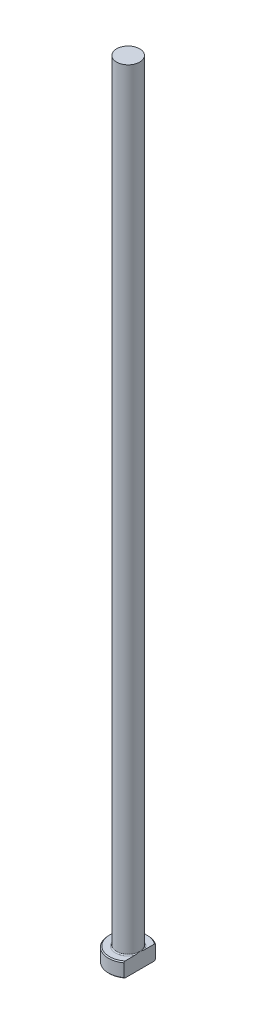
from build123d import *
from build123d.topology import SkipClean

# Parameters (mm, degrees)
CHAMFER1_SIZE = 0.2
FILLET1_R     = 0.2
KEY_DEPTH     = 161.09996877


with BuildPart() as part:
    # Sketch1 → Revolve1 (revolve)
    with BuildSketch(Plane.XY, mode=Mode.PRIVATE) as revolve1_sk:
        Polygon((0, 0), (-4, 0), (-4, 3), (-2.35, 3), (-2.35, 160), (0, 160), align=None)
    revolve(revolve1_sk.sketch.rotate(Axis((0, 259.958771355, 0), (0, -1, 0)), 270), axis=Axis((0, 259.958771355, 0), (0, -1, 0)))

    # Chamfer1
    chamfer1_edges = [part.edges().sort_by_distance(p)[0] for p in [
        (0, 3, -4),
        (0, 0, -4),
    ]]
    chamfer(chamfer1_edges, length=CHAMFER1_SIZE)

    # Fillet1
    fillet1_edges = [part.edges().sort_by_distance(p)[0] for p in [
        (0, 3, -2.35),
    ]]
    fillet(fillet1_edges, radius=FILLET1_R)

    # Sketch2 → KEY (cut, through all)
    with SkipClean():  # the faces are left unmerged after this step: merging them gives an invalid solid
        with BuildSketch(Plane(origin=(0, 0, 0), x_dir=(1, 0, 0), z_dir=(0, 1, 0))):
            with BuildLine():
                Line((2.35, 3.236896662), (2.35, -3.236896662))
                ThreePointArc((2.35, -3.236896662), (4, 0), (2.35, 3.236896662))
            make_face()
        extrude(amount=KEY_DEPTH, mode=Mode.SUBTRACT)


solid = part.part
